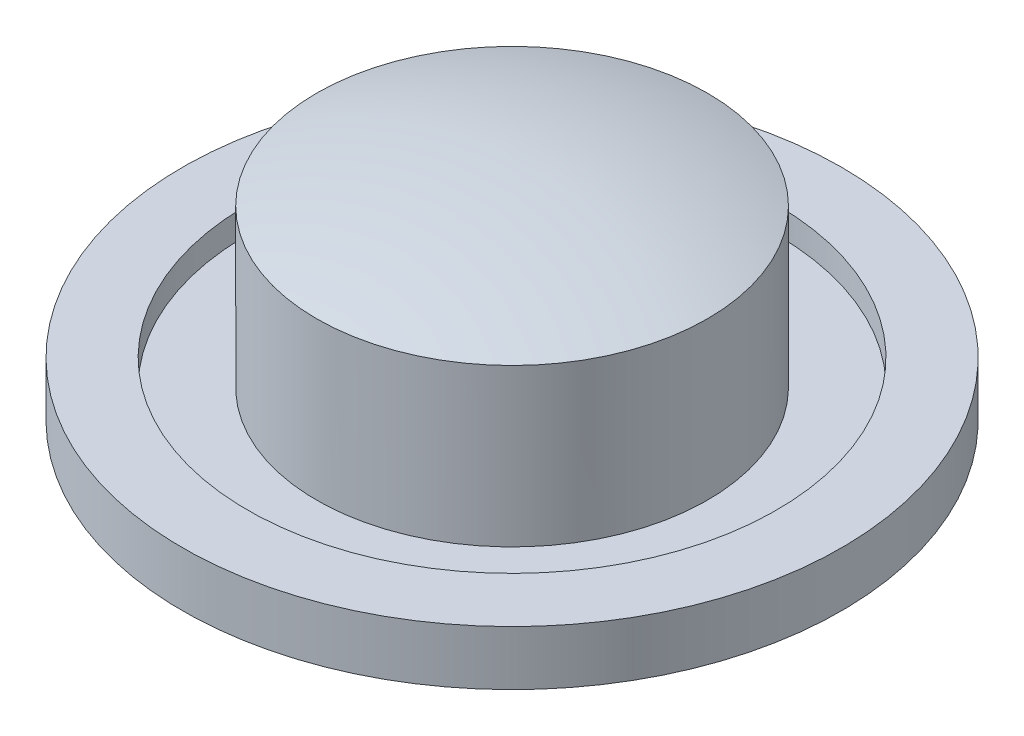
from build123d import *


with BuildPart() as part:
    # Sketch1 → Revolve1 (revolve)
    with BuildSketch(Plane.XY, mode=Mode.PRIVATE) as revolve1_sk:
        with BuildLine():
            Line((39.224019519, 37.301273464), (39.224019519, 5.768238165))
            Line((39.224019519, 5.768238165), (53.067791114, 5.768238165))
            Line((53.067791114, 5.768238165), (53.067791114, 10.959652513))
            Line((53.067791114, 10.959652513), (66.142464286, 10.959652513))
            Line((66.142464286, 10.959652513), (66.142464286, 0))
            Line((66.142464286, 0), (0, 0))
            Line((0, 0), (0, 43.83861005))
            ThreePointArc((0, 43.83861005), (19.882533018, 42.193081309), (39.224019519, 37.301273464))
        make_face()
    revolve(revolve1_sk.sketch.rotate(Axis((0, 0, 0), (0, 1, 0)), 90), axis=Axis((0, 0, 0), (0, 1, 0)))


solid = part.part
